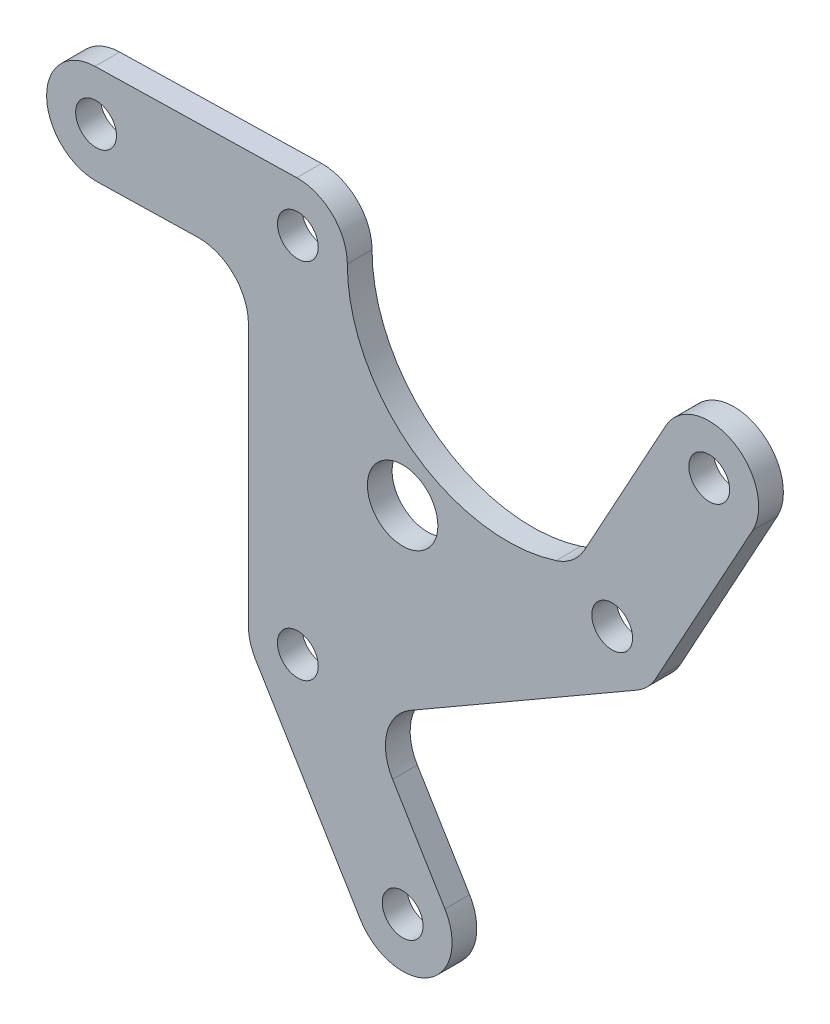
from build123d import *

# Parameters (mm, degrees)
SKETCH_2_R      = 1.65
SKETCH_2_R_2    = 2.85
EXTRUDE_1_DEPTH = 2
SKETCH_3_R      = 1.65
EXTRUDE_2_DEPTH = 2
FILLET_1_R      = 4


with BuildPart() as part:
    # Sketch 2 → Extrude 1 (new body)
    with BuildSketch(Plane.XY):
        with BuildLine():
            Line((-12.475, 14.679130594), (-12.475, -14.679130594))
            ThreePointArc((-12.475, -14.679130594), (-10.475, -18.143232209), (-6.475, -18.143232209))
            Line((-6.475, -18.143232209), (18.95, -3.464101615))
            ThreePointArc((18.95, -3.464101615), (20.414101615, 2), (14.95, 3.464101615))
            ThreePointArc((14.95, 3.464101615), (2, 3.464101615), (-4.475, 14.679130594))
            ThreePointArc((-4.475, 14.679130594), (-8.475, 18.679130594), (-12.475, 14.679130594))
        make_face()
        with Locations((-8.475, 14.679130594)):
            Circle(SKETCH_2_R, mode=Mode.SUBTRACT)
        with Locations((16.95, 0)):
            Circle(SKETCH_2_R, mode=Mode.SUBTRACT)
        with Locations((-8.475, -14.679130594)):
            Circle(SKETCH_2_R, mode=Mode.SUBTRACT)
        Circle(SKETCH_2_R_2, mode=Mode.SUBTRACT)
    extrude(amount=EXTRUDE_1_DEPTH)

    # Sketch 3 → Extrude 2 (add)
    # profile 1 of 3: a face of its own
    with BuildSketch(Plane.XY):
        with BuildLine():
            Line((-24.888393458, 18.317309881), (-8.563393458, 18.678153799))
            ThreePointArc((-8.563393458, 18.678153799), (-4.475976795, 14.767524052), (-8.386606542, 10.680107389))
            Line((-8.386606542, 10.680107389), (-24.711606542, 10.319263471))
            ThreePointArc((-24.711606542, 10.319263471), (-28.799023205, 14.229893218), (-24.888393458, 18.317309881))
        make_face()
        with Locations((-24.8, 14.318286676)):
            Circle(SKETCH_3_R, mode=Mode.SUBTRACT)
        with Locations((-8.475, 14.679130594)):
            Circle(SKETCH_3_R, mode=Mode.SUBTRACT)
    # profile 2 of 3: a face of its own
    with BuildSketch(Plane.XY):
        with BuildLine():
            Line((28.307452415, 12.395326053), (20.457452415, -1.922960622))
            ThreePointArc((20.457452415, -1.922960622), (15.027039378, -3.507452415), (13.442547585, 1.922960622))
            Line((13.442547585, 1.922960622), (21.292547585, 16.241247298))
            ThreePointArc((21.292547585, 16.241247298), (26.722960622, 17.825739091), (28.307452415, 12.395326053))
        make_face()
        with Locations((24.8, 14.318286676)):
            Circle(SKETCH_3_R, mode=Mode.SUBTRACT)
        with Locations((16.95, 0)):
            Circle(SKETCH_3_R, mode=Mode.SUBTRACT)
    # profile 3 of 3: a face of its own
    with BuildSketch(Plane.XY):
        with BuildLine():
            Line((-3.419058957, -30.712635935), (-11.894058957, -16.755193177))
            ThreePointArc((-11.894058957, -16.755193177), (-10.551062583, -11.260071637), (-5.055941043, -12.603068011))
            Line((-5.055941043, -12.603068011), (3.419058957, -26.560510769))
            ThreePointArc((3.419058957, -26.560510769), (2.076062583, -32.055632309), (-3.419058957, -30.712635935))
        make_face()
        with Locations((0, -28.636573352)):
            Circle(SKETCH_3_R, mode=Mode.SUBTRACT)
        with Locations((-8.475, -14.679130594)):
            Circle(SKETCH_3_R, mode=Mode.SUBTRACT)
    extrude(amount=EXTRUDE_2_DEPTH)

    # Fillet 1
    fillet_1_edges = [part.edges().sort_by_distance(p)[0] for p in [
        (14.020079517, 2.976370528, 1),
        (-2.933482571, -16.098536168, 1),
        (-12.475, 10.589738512, 1),
    ]]
    fillet(fillet_1_edges, radius=FILLET_1_R)


solid = part.part
